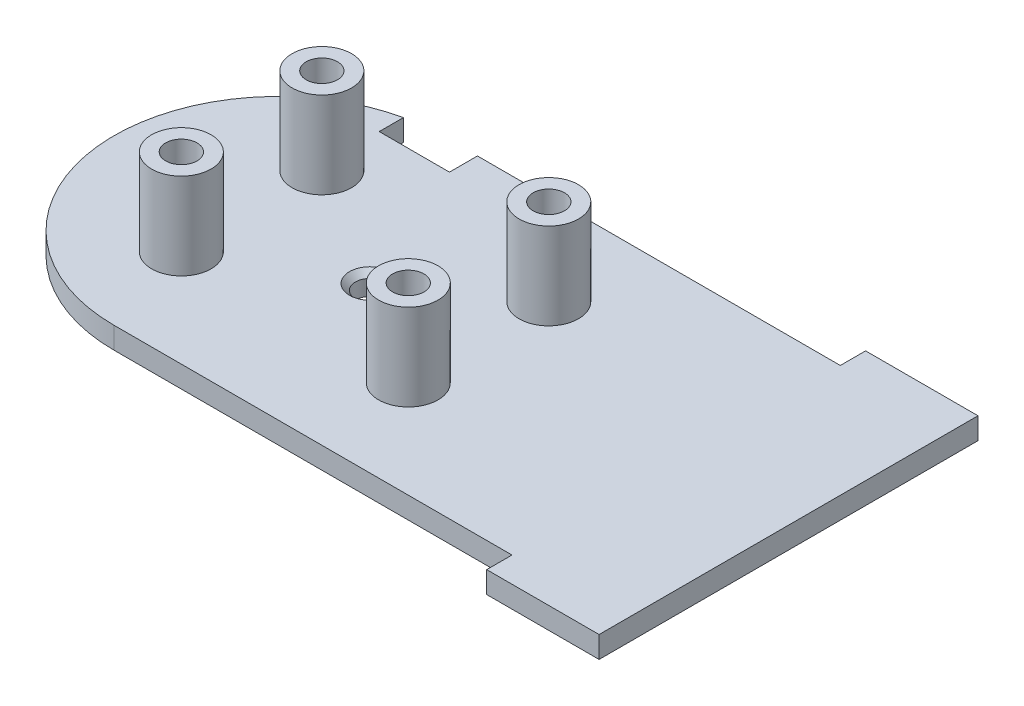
ISO-10303-21;
HEADER;
FILE_DESCRIPTION(('STEP AP214'),'2;1');
FILE_NAME('part.step','',(''),(''),'','','');
FILE_SCHEMA(('AUTOMOTIVE_DESIGN { 1 0 10303 214 1 1 1 1 }'));
ENDSEC;
DATA;
#1=APPLICATION_CONTEXT('core data for automotive mechanical design processes');
#2=APPLICATION_PROTOCOL_DEFINITION('international standard','automotive_design',2000,#1);
#3=PRODUCT_CONTEXT('',#1,'mechanical');
#4=PRODUCT('Part','Part','',(#3));
#5=PRODUCT_RELATED_PRODUCT_CATEGORY('part','',(#4));
#6=PRODUCT_DEFINITION_FORMATION('','',#4);
#7=PRODUCT_DEFINITION_CONTEXT('part definition',#1,'design');
#8=PRODUCT_DEFINITION('design','',#6,#7);
#9=PRODUCT_DEFINITION_SHAPE('','',#8);
#10=(LENGTH_UNIT() NAMED_UNIT(*) SI_UNIT(.MILLI.,.METRE.));
#11=(NAMED_UNIT(*) PLANE_ANGLE_UNIT() SI_UNIT($,.RADIAN.));
#12=(NAMED_UNIT(*) SI_UNIT($,.STERADIAN.) SOLID_ANGLE_UNIT());
#13=UNCERTAINTY_MEASURE_WITH_UNIT(LENGTH_MEASURE(1.E-05),#10,'distance_accuracy_value','');
#14=(GEOMETRIC_REPRESENTATION_CONTEXT(3) GLOBAL_UNCERTAINTY_ASSIGNED_CONTEXT((#13)) GLOBAL_UNIT_ASSIGNED_CONTEXT((#10,
#11,#12)) REPRESENTATION_CONTEXT('',''));
#15=CARTESIAN_POINT('',(0.,0.,0.));
#16=DIRECTION('',(0.,0.,1.));
#17=DIRECTION('',(1.,0.,0.));
#18=AXIS2_PLACEMENT_3D('',#15,#16,#17);
#19=CARTESIAN_POINT('',(-4.6,-0.1,-6.2));
#20=DIRECTION('',(0.,0.,1.));
#21=DIRECTION('',(1.,0.,0.));
#22=AXIS2_PLACEMENT_3D('',#19,#20,#21);
#23=PLANE('',#22);
#24=DIRECTION('',(0.,1.,0.));
#25=VECTOR('',#24,1.);
#26=CARTESIAN_POINT('',(4.6,-0.1,-6.2));
#27=LINE('',#26,#25);
#28=CARTESIAN_POINT('',(4.6,0.,-6.2));
#29=VERTEX_POINT('',#28);
#30=CARTESIAN_POINT('',(4.6,1.7,-6.2));
#31=VERTEX_POINT('',#30);
#32=EDGE_CURVE('E348',#29,#31,#27,.T.);
#33=ORIENTED_EDGE('',*,*,#32,.F.);
#34=DIRECTION('',(1.,0.,0.));
#35=VECTOR('',#34,1.);
#36=CARTESIAN_POINT('',(-4.6,0.,-6.2));
#37=LINE('',#36,#35);
#38=CARTESIAN_POINT('',(4.5,0.,-6.2));
#39=VERTEX_POINT('',#38);
#40=EDGE_CURVE('E350',#39,#29,#37,.T.);
#41=ORIENTED_EDGE('',*,*,#40,.F.);
#42=DIRECTION('',(0.,1.,0.));
#43=VECTOR('',#42,1.);
#44=CARTESIAN_POINT('',(4.5,-0.1,-6.2));
#45=LINE('',#44,#43);
#46=CARTESIAN_POINT('',(4.5,1.5,-6.2));
#47=VERTEX_POINT('',#46);
#48=EDGE_CURVE('E352',#47,#39,#45,.F.);
#49=ORIENTED_EDGE('',*,*,#48,.F.);
#50=DIRECTION('',(1.,0.,0.));
#51=VECTOR('',#50,1.);
#52=CARTESIAN_POINT('',(0.,1.5,-6.2));
#53=LINE('',#52,#51);
#54=CARTESIAN_POINT('',(-4.5,1.5,-6.2));
#55=VERTEX_POINT('',#54);
#56=EDGE_CURVE('E341',#47,#55,#53,.F.);
#57=ORIENTED_EDGE('',*,*,#56,.T.);
#58=DIRECTION('',(0.,1.,0.));
#59=VECTOR('',#58,1.);
#60=CARTESIAN_POINT('',(-4.5,-0.1,-6.2));
#61=LINE('',#60,#59);
#62=CARTESIAN_POINT('',(-4.5,0.,-6.2));
#63=VERTEX_POINT('',#62);
#64=EDGE_CURVE('E354',#63,#55,#61,.T.);
#65=ORIENTED_EDGE('',*,*,#64,.F.);
#66=DIRECTION('',(1.,0.,0.));
#67=VECTOR('',#66,1.);
#68=CARTESIAN_POINT('',(-4.6,0.,-6.2));
#69=LINE('',#68,#67);
#70=CARTESIAN_POINT('',(-4.6,0.,-6.2));
#71=VERTEX_POINT('',#70);
#72=EDGE_CURVE('E356',#71,#63,#69,.T.);
#73=ORIENTED_EDGE('',*,*,#72,.F.);
#74=DIRECTION('',(0.,1.,0.));
#75=VECTOR('',#74,1.);
#76=CARTESIAN_POINT('',(-4.6,-0.1,-6.2));
#77=LINE('',#76,#75);
#78=CARTESIAN_POINT('',(-4.6,1.7,-6.2));
#79=VERTEX_POINT('',#78);
#80=EDGE_CURVE('E358',#79,#71,#77,.F.);
#81=ORIENTED_EDGE('',*,*,#80,.F.);
#82=DIRECTION('',(1.,0.,0.));
#83=VECTOR('',#82,1.);
#84=CARTESIAN_POINT('',(-4.6,1.7,-6.2));
#85=LINE('',#84,#83);
#86=EDGE_CURVE('E316',#79,#31,#85,.T.);
#87=ORIENTED_EDGE('',*,*,#86,.T.);
#88=EDGE_LOOP('',(#33,#41,#49,#57,#65,#73,#81,#87));
#89=FACE_BOUND('',#88,.T.);
#90=ADVANCED_FACE('F16',(#89),#23,.F.);
#91=CARTESIAN_POINT('',(-4.6,-0.1,-7.9));
#92=DIRECTION('',(0.,0.,1.));
#93=DIRECTION('',(1.,0.,0.));
#94=AXIS2_PLACEMENT_3D('',#91,#92,#93);
#95=PLANE('',#94);
#96=DIRECTION('',(1.,0.,0.));
#97=VECTOR('',#96,1.);
#98=CARTESIAN_POINT('',(-4.6,0.,-7.9));
#99=LINE('',#98,#97);
#100=CARTESIAN_POINT('',(4.5,0.,-7.9));
#101=VERTEX_POINT('',#100);
#102=CARTESIAN_POINT('',(4.6,0.,-7.9));
#103=VERTEX_POINT('',#102);
#104=EDGE_CURVE('E344',#101,#103,#99,.T.);
#105=ORIENTED_EDGE('',*,*,#104,.T.);
#106=DIRECTION('',(0.,1.,0.));
#107=VECTOR('',#106,1.);
#108=CARTESIAN_POINT('',(4.6,-0.1,-7.9));
#109=LINE('',#108,#107);
#110=CARTESIAN_POINT('',(4.6,1.7,-7.9));
#111=VERTEX_POINT('',#110);
#112=EDGE_CURVE('E305',#103,#111,#109,.T.);
#113=ORIENTED_EDGE('',*,*,#112,.T.);
#114=DIRECTION('',(1.,0.,0.));
#115=VECTOR('',#114,1.);
#116=CARTESIAN_POINT('',(-4.6,1.7,-7.9));
#117=LINE('',#116,#115);
#118=CARTESIAN_POINT('',(3.25,1.7,-7.9));
#119=VERTEX_POINT('',#118);
#120=EDGE_CURVE('E313',#111,#119,#117,.F.);
#121=ORIENTED_EDGE('',*,*,#120,.T.);
#122=DIRECTION('',(0.,1.,0.));
#123=VECTOR('',#122,1.);
#124=CARTESIAN_POINT('',(3.25,-0.1,-7.9));
#125=LINE('',#124,#123);
#126=CARTESIAN_POINT('',(3.25,1.12487113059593,-7.89999999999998));
#127=VERTEX_POINT('',#126);
#128=EDGE_CURVE('E346',#119,#127,#125,.F.);
#129=ORIENTED_EDGE('',*,*,#128,.T.);
#130=DIRECTION('',(1.,0.,0.));
#131=VECTOR('',#130,1.);
#132=CARTESIAN_POINT('',(-10.29555495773,1.12487113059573,-7.89999999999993));
#133=LINE('',#132,#131);
#134=CARTESIAN_POINT('',(4.50000000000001,1.12487113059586,-7.89999999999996));
#135=VERTEX_POINT('',#134);
#136=EDGE_CURVE('E335',#135,#127,#133,.F.);
#137=ORIENTED_EDGE('',*,*,#136,.F.);
#138=DIRECTION('',(0.,1.,0.));
#139=VECTOR('',#138,1.);
#140=CARTESIAN_POINT('',(4.5,1.5,-7.9));
#141=LINE('',#140,#139);
#142=EDGE_CURVE('E307',#135,#101,#141,.F.);
#143=ORIENTED_EDGE('',*,*,#142,.T.);
#144=EDGE_LOOP('',(#105,#113,#121,#129,#137,#143));
#145=FACE_BOUND('',#144,.T.);
#146=ADVANCED_FACE('F587',(#145),#95,.T.);
#147=CARTESIAN_POINT('',(0.,1.5,0.));
#148=DIRECTION('',(0.,1.,0.));
#149=DIRECTION('',(0.,0.,1.));
#150=AXIS2_PLACEMENT_3D('',#147,#148,#149);
#151=PLANE('',#150);
#152=DIRECTION('',(0.,0.,-1.));
#153=VECTOR('',#152,1.);
#154=CARTESIAN_POINT('',(4.5,1.5,-6.5));
#155=LINE('',#154,#153);
#156=CARTESIAN_POINT('',(4.5,1.5,4.49999999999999));
#157=VERTEX_POINT('',#156);
#158=EDGE_CURVE('E300',#47,#157,#155,.F.);
#159=ORIENTED_EDGE('',*,*,#158,.T.);
#160=DIRECTION('',(1.,0.,0.));
#161=VECTOR('',#160,1.);
#162=CARTESIAN_POINT('',(-10.29555495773,1.5,4.5));
#163=LINE('',#162,#161);
#164=CARTESIAN_POINT('',(-4.5,1.5,4.5));
#165=VERTEX_POINT('',#164);
#166=EDGE_CURVE('E297',#165,#157,#163,.T.);
#167=ORIENTED_EDGE('',*,*,#166,.F.);
#168=DIRECTION('',(0.,0.,1.));
#169=VECTOR('',#168,1.);
#170=CARTESIAN_POINT('',(-4.5,1.5,-6.5));
#171=LINE('',#170,#169);
#172=EDGE_CURVE('E287',#165,#55,#171,.F.);
#173=ORIENTED_EDGE('',*,*,#172,.T.);
#174=ORIENTED_EDGE('',*,*,#56,.F.);
#175=EDGE_LOOP('',(#159,#167,#173,#174));
#176=FACE_BOUND('',#175,.T.);
#177=ADVANCED_FACE('F584',(#176),#151,.F.);
#178=CARTESIAN_POINT('',(-4.6,-0.1,-7.9));
#179=DIRECTION('',(0.,0.,1.));
#180=DIRECTION('',(1.,0.,0.));
#181=AXIS2_PLACEMENT_3D('',#178,#179,#180);
#182=PLANE('',#181);
#183=DIRECTION('',(0.,1.,0.));
#184=VECTOR('',#183,1.);
#185=CARTESIAN_POINT('',(-3.25,-0.1,-7.9));
#186=LINE('',#185,#184);
#187=CARTESIAN_POINT('',(-3.25,1.12487113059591,-7.89999999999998));
#188=VERTEX_POINT('',#187);
#189=CARTESIAN_POINT('',(-3.25,1.7,-7.9));
#190=VERTEX_POINT('',#189);
#191=EDGE_CURVE('E338',#188,#190,#186,.T.);
#192=ORIENTED_EDGE('',*,*,#191,.T.);
#193=DIRECTION('',(1.,0.,0.));
#194=VECTOR('',#193,1.);
#195=CARTESIAN_POINT('',(-4.6,1.7,-7.9));
#196=LINE('',#195,#194);
#197=CARTESIAN_POINT('',(-4.6,1.7,-7.9));
#198=VERTEX_POINT('',#197);
#199=EDGE_CURVE('E319',#190,#198,#196,.F.);
#200=ORIENTED_EDGE('',*,*,#199,.T.);
#201=DIRECTION('',(0.,1.,0.));
#202=VECTOR('',#201,1.);
#203=CARTESIAN_POINT('',(-4.6,-0.1,-7.9));
#204=LINE('',#203,#202);
#205=CARTESIAN_POINT('',(-4.6,0.,-7.9));
#206=VERTEX_POINT('',#205);
#207=EDGE_CURVE('E290',#206,#198,#204,.T.);
#208=ORIENTED_EDGE('',*,*,#207,.F.);
#209=DIRECTION('',(1.,0.,0.));
#210=VECTOR('',#209,1.);
#211=CARTESIAN_POINT('',(-4.6,0.,-7.9));
#212=LINE('',#211,#210);
#213=CARTESIAN_POINT('',(-4.5,0.,-7.9));
#214=VERTEX_POINT('',#213);
#215=EDGE_CURVE('E339',#206,#214,#212,.T.);
#216=ORIENTED_EDGE('',*,*,#215,.T.);
#217=DIRECTION('',(0.,1.,0.));
#218=VECTOR('',#217,1.);
#219=CARTESIAN_POINT('',(-4.5,1.5,-7.9));
#220=LINE('',#219,#218);
#221=CARTESIAN_POINT('',(-4.5,1.12487113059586,-7.89999999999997));
#222=VERTEX_POINT('',#221);
#223=EDGE_CURVE('E366',#214,#222,#220,.T.);
#224=ORIENTED_EDGE('',*,*,#223,.T.);
#225=DIRECTION('',(1.,0.,0.));
#226=VECTOR('',#225,1.);
#227=CARTESIAN_POINT('',(-10.29555495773,1.12487113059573,-7.89999999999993));
#228=LINE('',#227,#226);
#229=EDGE_CURVE('E326',#188,#222,#228,.F.);
#230=ORIENTED_EDGE('',*,*,#229,.F.);
#231=EDGE_LOOP('',(#192,#200,#208,#216,#224,#230));
#232=FACE_BOUND('',#231,.T.);
#233=ADVANCED_FACE('F580',(#232),#182,.T.);
#234=CARTESIAN_POINT('',(-10.29555495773,1.5,-6.5));
#235=DIRECTION('',(0.,-0.965925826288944,0.258819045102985));
#236=DIRECTION('',(0.,-0.258819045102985,-0.965925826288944));
#237=AXIS2_PLACEMENT_3D('',#234,#235,#236);
#238=PLANE('',#237);
#239=DIRECTION('',(0.,-0.25881904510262,-0.965925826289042));
#240=VECTOR('',#239,1.);
#241=CARTESIAN_POINT('',(3.25,1.124871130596,-7.9));
#242=LINE('',#241,#240);
#243=CARTESIAN_POINT('',(3.25000000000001,-9.30679144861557E-13,-12.0980762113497));
#244=VERTEX_POINT('',#243);
#245=EDGE_CURVE('E279',#127,#244,#242,.T.);
#246=ORIENTED_EDGE('',*,*,#245,.T.);
#247=DIRECTION('',(1.,0.,0.));
#248=VECTOR('',#247,1.);
#249=CARTESIAN_POINT('',(-10.29555495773,-1.86135828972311E-12,-12.0980762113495));
#250=LINE('',#249,#248);
#251=CARTESIAN_POINT('',(4.50000000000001,-9.30245463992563E-13,-12.0980762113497));
#252=VERTEX_POINT('',#251);
#253=EDGE_CURVE('E331',#244,#252,#250,.T.);
#254=ORIENTED_EDGE('',*,*,#253,.T.);
#255=DIRECTION('',(0.,0.25881904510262,0.965925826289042));
#256=VECTOR('',#255,1.);
#257=CARTESIAN_POINT('',(4.5,0.,-12.09807621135));
#258=LINE('',#257,#256);
#259=EDGE_CURVE('E310',#252,#135,#258,.T.);
#260=ORIENTED_EDGE('',*,*,#259,.T.);
#261=ORIENTED_EDGE('',*,*,#136,.T.);
#262=EDGE_LOOP('',(#246,#254,#260,#261));
#263=FACE_BOUND('',#262,.T.);
#264=ADVANCED_FACE('F576',(#263),#238,.T.);
#265=CARTESIAN_POINT('',(-10.29555495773,1.5,-6.5));
#266=DIRECTION('',(0.,-0.965925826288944,0.258819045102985));
#267=DIRECTION('',(0.,-0.258819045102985,-0.965925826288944));
#268=AXIS2_PLACEMENT_3D('',#265,#266,#267);
#269=PLANE('',#268);
#270=DIRECTION('',(0.,-0.25881904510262,-0.965925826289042));
#271=VECTOR('',#270,1.);
#272=CARTESIAN_POINT('',(-4.5,1.124871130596,-7.9));
#273=LINE('',#272,#271);
#274=CARTESIAN_POINT('',(-4.5,-1.86135828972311E-12,-12.0980762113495));
#275=VERTEX_POINT('',#274);
#276=EDGE_CURVE('E283',#222,#275,#273,.T.);
#277=ORIENTED_EDGE('',*,*,#276,.T.);
#278=DIRECTION('',(1.,0.,0.));
#279=VECTOR('',#278,1.);
#280=CARTESIAN_POINT('',(-10.29555495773,-1.86135828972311E-12,-12.0980762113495));
#281=LINE('',#280,#279);
#282=CARTESIAN_POINT('',(-3.25,-6.2052504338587E-13,-12.0980762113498));
#283=VERTEX_POINT('',#282);
#284=EDGE_CURVE('E321',#275,#283,#281,.T.);
#285=ORIENTED_EDGE('',*,*,#284,.T.);
#286=DIRECTION('',(0.,-0.25881904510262,-0.965925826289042));
#287=VECTOR('',#286,1.);
#288=CARTESIAN_POINT('',(-3.25,1.124871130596,-7.9));
#289=LINE('',#288,#287);
#290=EDGE_CURVE('E282',#188,#283,#289,.T.);
#291=ORIENTED_EDGE('',*,*,#290,.F.);
#292=ORIENTED_EDGE('',*,*,#229,.T.);
#293=EDGE_LOOP('',(#277,#285,#291,#292));
#294=FACE_BOUND('',#293,.T.);
#295=ADVANCED_FACE('F573',(#294),#269,.T.);
#296=CARTESIAN_POINT('',(-2.775,5.,-6.816883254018));
#297=DIRECTION('',(0.,1.,0.));
#298=DIRECTION('',(0.,0.,1.));
#299=AXIS2_PLACEMENT_3D('',#296,#297,#298);
#300=PLANE('',#299);
#301=CARTESIAN_POINT('',(-2.775,5.,-6.816883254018));
#302=DIRECTION('',(0.,1.,0.));
#303=DIRECTION('',(0.,0.,1.));
#304=AXIS2_PLACEMENT_3D('',#301,#302,#303);
#305=CIRCLE('',#304,1.45);
#306=CARTESIAN_POINT('',(-2.775,5.,-5.366883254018));
#307=VERTEX_POINT('',#306);
#308=EDGE_CURVE('E19',#307,#307,#305,.T.);
#309=ORIENTED_EDGE('',*,*,#308,.T.);
#310=EDGE_LOOP('',(#309));
#311=FACE_BOUND('',#310,.T.);
#312=ADVANCED_FACE('F431',(#311),#300,.T.);
#313=CARTESIAN_POINT('',(-2.775,5.,6.183116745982));
#314=DIRECTION('',(0.,1.,0.));
#315=DIRECTION('',(0.,0.,1.));
#316=AXIS2_PLACEMENT_3D('',#313,#314,#315);
#317=PLANE('',#316);
#318=CARTESIAN_POINT('',(-2.775,5.,6.183116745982));
#319=DIRECTION('',(0.,1.,0.));
#320=DIRECTION('',(0.,0.,1.));
#321=AXIS2_PLACEMENT_3D('',#318,#319,#320);
#322=CIRCLE('',#321,1.45);
#323=CARTESIAN_POINT('',(-2.775,5.,7.633116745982));
#324=VERTEX_POINT('',#323);
#325=EDGE_CURVE('E424',#324,#324,#322,.T.);
#326=ORIENTED_EDGE('',*,*,#325,.T.);
#327=EDGE_LOOP('',(#326));
#328=FACE_BOUND('',#327,.T.);
#329=ADVANCED_FACE('F559',(#328),#317,.T.);
#330=CARTESIAN_POINT('',(18.225,5.,-6.816883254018));
#331=DIRECTION('',(0.,1.,0.));
#332=DIRECTION('',(0.,0.,1.));
#333=AXIS2_PLACEMENT_3D('',#330,#331,#332);
#334=PLANE('',#333);
#335=CARTESIAN_POINT('',(18.225,5.,-6.816883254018));
#336=DIRECTION('',(0.,1.,0.));
#337=DIRECTION('',(0.,0.,1.));
#338=AXIS2_PLACEMENT_3D('',#335,#336,#337);
#339=CIRCLE('',#338,1.45);
#340=CARTESIAN_POINT('',(18.225,5.,-5.366883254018));
#341=VERTEX_POINT('',#340);
#342=EDGE_CURVE('E422',#341,#341,#339,.T.);
#343=ORIENTED_EDGE('',*,*,#342,.T.);
#344=EDGE_LOOP('',(#343));
#345=FACE_BOUND('',#344,.T.);
#346=ADVANCED_FACE('F556',(#345),#334,.T.);
#347=CARTESIAN_POINT('',(18.225,5.,6.183116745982));
#348=DIRECTION('',(0.,1.,0.));
#349=DIRECTION('',(0.,0.,1.));
#350=AXIS2_PLACEMENT_3D('',#347,#348,#349);
#351=PLANE('',#350);
#352=CARTESIAN_POINT('',(18.225,5.,6.183116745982));
#353=DIRECTION('',(0.,1.,0.));
#354=DIRECTION('',(0.,0.,1.));
#355=AXIS2_PLACEMENT_3D('',#352,#353,#354);
#356=CIRCLE('',#355,1.45);
#357=CARTESIAN_POINT('',(18.225,5.,7.633116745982));
#358=VERTEX_POINT('',#357);
#359=EDGE_CURVE('E268',#358,#358,#356,.T.);
#360=ORIENTED_EDGE('',*,*,#359,.T.);
#361=EDGE_LOOP('',(#360));
#362=FACE_BOUND('',#361,.T.);
#363=ADVANCED_FACE('F558',(#362),#351,.T.);
#364=CARTESIAN_POINT('',(4.5,1.5,-6.5));
#365=DIRECTION('',(1.,0.,0.));
#366=DIRECTION('',(0.,0.,-1.));
#367=AXIS2_PLACEMENT_3D('',#364,#365,#366);
#368=PLANE('',#367);
#369=ORIENTED_EDGE('',*,*,#259,.F.);
#370=DIRECTION('',(0.,0.,1.));
#371=VECTOR('',#370,1.);
#372=CARTESIAN_POINT('',(4.5,0.,0.));
#373=LINE('',#372,#371);
#374=EDGE_CURVE('E266',#252,#101,#373,.T.);
#375=ORIENTED_EDGE('',*,*,#374,.T.);
#376=ORIENTED_EDGE('',*,*,#142,.F.);
#377=EDGE_LOOP('',(#369,#375,#376));
#378=FACE_BOUND('',#377,.T.);
#379=ADVANCED_FACE('F565',(#378),#368,.F.);
#380=CARTESIAN_POINT('',(4.6,-0.1,-7.9));
#381=DIRECTION('',(1.,0.,0.));
#382=DIRECTION('',(0.,0.,-1.));
#383=AXIS2_PLACEMENT_3D('',#380,#381,#382);
#384=PLANE('',#383);
#385=ORIENTED_EDGE('',*,*,#112,.F.);
#386=DIRECTION('',(0.,0.,1.));
#387=VECTOR('',#386,1.);
#388=CARTESIAN_POINT('',(4.6,0.,0.));
#389=LINE('',#388,#387);
#390=EDGE_CURVE('E263',#103,#29,#389,.T.);
#391=ORIENTED_EDGE('',*,*,#390,.T.);
#392=ORIENTED_EDGE('',*,*,#32,.T.);
#393=DIRECTION('',(0.,0.,-1.));
#394=VECTOR('',#393,1.);
#395=CARTESIAN_POINT('',(4.6,1.7,-7.9));
#396=LINE('',#395,#394);
#397=EDGE_CURVE('E302',#111,#31,#396,.F.);
#398=ORIENTED_EDGE('',*,*,#397,.F.);
#399=EDGE_LOOP('',(#385,#391,#392,#398));
#400=FACE_BOUND('',#399,.T.);
#401=ADVANCED_FACE('F602',(#400),#384,.F.);
#402=CARTESIAN_POINT('',(4.5,1.5,-6.5));
#403=DIRECTION('',(1.,0.,0.));
#404=DIRECTION('',(0.,0.,-1.));
#405=AXIS2_PLACEMENT_3D('',#402,#403,#404);
#406=PLANE('',#405);
#407=ORIENTED_EDGE('',*,*,#158,.F.);
#408=ORIENTED_EDGE('',*,*,#48,.T.);
#409=DIRECTION('',(0.,0.,1.));
#410=VECTOR('',#409,1.);
#411=CARTESIAN_POINT('',(4.5,0.,0.));
#412=LINE('',#411,#410);
#413=CARTESIAN_POINT('',(4.5,-2.91054073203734E-13,10.0980762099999));
#414=VERTEX_POINT('',#413);
#415=EDGE_CURVE('E261',#39,#414,#412,.T.);
#416=ORIENTED_EDGE('',*,*,#415,.T.);
#417=DIRECTION('',(0.,0.2588190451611,-0.965925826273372));
#418=VECTOR('',#417,1.);
#419=CARTESIAN_POINT('',(4.50000000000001,1.5,4.5));
#420=LINE('',#419,#418);
#421=EDGE_CURVE('E294',#157,#414,#420,.F.);
#422=ORIENTED_EDGE('',*,*,#421,.F.);
#423=EDGE_LOOP('',(#407,#408,#416,#422));
#424=FACE_BOUND('',#423,.T.);
#425=ADVANCED_FACE('F626',(#424),#406,.F.);
#426=CARTESIAN_POINT('',(-10.29555495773,1.5,4.5));
#427=DIRECTION('',(0.,-0.965925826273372,-0.2588190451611));
#428=DIRECTION('',(0.,0.2588190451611,-0.965925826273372));
#429=AXIS2_PLACEMENT_3D('',#426,#427,#428);
#430=PLANE('',#429);
#431=ORIENTED_EDGE('',*,*,#421,.T.);
#432=DIRECTION('',(1.,0.,0.));
#433=VECTOR('',#432,1.);
#434=CARTESIAN_POINT('',(0.,0.,10.09807621));
#435=LINE('',#434,#433);
#436=CARTESIAN_POINT('',(-4.5,-5.83734449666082E-13,10.0980762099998));
#437=VERTEX_POINT('',#436);
#438=EDGE_CURVE('E259',#414,#437,#435,.F.);
#439=ORIENTED_EDGE('',*,*,#438,.T.);
#440=DIRECTION('',(0.,0.258819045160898,-0.965925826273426));
#441=VECTOR('',#440,1.);
#442=CARTESIAN_POINT('',(-4.5,0.,10.09807621));
#443=LINE('',#442,#441);
#444=EDGE_CURVE('E291',#437,#165,#443,.T.);
#445=ORIENTED_EDGE('',*,*,#444,.T.);
#446=ORIENTED_EDGE('',*,*,#166,.T.);
#447=EDGE_LOOP('',(#431,#439,#445,#446));
#448=FACE_BOUND('',#447,.T.);
#449=ADVANCED_FACE('F631',(#448),#430,.T.);
#450=CARTESIAN_POINT('',(-4.5,1.5,-6.5));
#451=DIRECTION('',(-1.,0.,0.));
#452=DIRECTION('',(0.,0.,1.));
#453=AXIS2_PLACEMENT_3D('',#450,#451,#452);
#454=PLANE('',#453);
#455=ORIENTED_EDGE('',*,*,#172,.F.);
#456=ORIENTED_EDGE('',*,*,#444,.F.);
#457=DIRECTION('',(0.,0.,1.));
#458=VECTOR('',#457,1.);
#459=CARTESIAN_POINT('',(-4.5,0.,0.));
#460=LINE('',#459,#458);
#461=EDGE_CURVE('E256',#437,#63,#460,.F.);
#462=ORIENTED_EDGE('',*,*,#461,.T.);
#463=ORIENTED_EDGE('',*,*,#64,.T.);
#464=EDGE_LOOP('',(#455,#456,#462,#463));
#465=FACE_BOUND('',#464,.T.);
#466=ADVANCED_FACE('F635',(#465),#454,.F.);
#467=CARTESIAN_POINT('',(-4.6,-0.1,-7.9));
#468=DIRECTION('',(1.,0.,0.));
#469=DIRECTION('',(0.,0.,-1.));
#470=AXIS2_PLACEMENT_3D('',#467,#468,#469);
#471=PLANE('',#470);
#472=ORIENTED_EDGE('',*,*,#207,.T.);
#473=DIRECTION('',(0.,0.,-1.));
#474=VECTOR('',#473,1.);
#475=CARTESIAN_POINT('',(-4.6,1.7,-7.9));
#476=LINE('',#475,#474);
#477=EDGE_CURVE('E363',#198,#79,#476,.F.);
#478=ORIENTED_EDGE('',*,*,#477,.T.);
#479=ORIENTED_EDGE('',*,*,#80,.T.);
#480=DIRECTION('',(0.,0.,1.));
#481=VECTOR('',#480,1.);
#482=CARTESIAN_POINT('',(-4.6,0.,0.));
#483=LINE('',#482,#481);
#484=EDGE_CURVE('E253',#71,#206,#483,.F.);
#485=ORIENTED_EDGE('',*,*,#484,.T.);
#486=EDGE_LOOP('',(#472,#478,#479,#485));
#487=FACE_BOUND('',#486,.T.);
#488=ADVANCED_FACE('F447',(#487),#471,.T.);
#489=CARTESIAN_POINT('',(-4.5,1.5,-6.5));
#490=DIRECTION('',(-1.,0.,0.));
#491=DIRECTION('',(0.,0.,1.));
#492=AXIS2_PLACEMENT_3D('',#489,#490,#491);
#493=PLANE('',#492);
#494=ORIENTED_EDGE('',*,*,#223,.F.);
#495=DIRECTION('',(0.,0.,1.));
#496=VECTOR('',#495,1.);
#497=CARTESIAN_POINT('',(-4.5,0.,0.));
#498=LINE('',#497,#496);
#499=EDGE_CURVE('E243',#214,#275,#498,.F.);
#500=ORIENTED_EDGE('',*,*,#499,.T.);
#501=ORIENTED_EDGE('',*,*,#276,.F.);
#502=EDGE_LOOP('',(#494,#500,#501));
#503=FACE_BOUND('',#502,.T.);
#504=ADVANCED_FACE('F436',(#503),#493,.F.);
#505=CARTESIAN_POINT('',(-2.775,5.,-6.816883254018));
#506=DIRECTION('',(0.,1.,0.));
#507=DIRECTION('',(0.,0.,1.));
#508=AXIS2_PLACEMENT_3D('',#505,#506,#507);
#509=CYLINDRICAL_SURFACE('',#508,1.45);
#510=CARTESIAN_POINT('',(-2.775,10.,-6.816883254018));
#511=DIRECTION('',(0.,1.,0.));
#512=DIRECTION('',(0.,0.,1.));
#513=AXIS2_PLACEMENT_3D('',#510,#511,#512);
#514=CIRCLE('',#513,1.45);
#515=CARTESIAN_POINT('',(-2.775,10.,-5.366883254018));
#516=VERTEX_POINT('',#515);
#517=EDGE_CURVE('E246',#516,#516,#514,.F.);
#518=ORIENTED_EDGE('',*,*,#517,.F.);
#519=EDGE_LOOP('',(#518));
#520=FACE_BOUND('',#519,.T.);
#521=ORIENTED_EDGE('',*,*,#308,.F.);
#522=EDGE_LOOP('',(#521));
#523=FACE_BOUND('',#522,.T.);
#524=ADVANCED_FACE('F433',(#520,#523),#509,.F.);
#525=CARTESIAN_POINT('',(-2.775,5.,6.183116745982));
#526=DIRECTION('',(0.,1.,0.));
#527=DIRECTION('',(0.,0.,1.));
#528=AXIS2_PLACEMENT_3D('',#525,#526,#527);
#529=CYLINDRICAL_SURFACE('',#528,1.45);
#530=CARTESIAN_POINT('',(-2.775,10.,6.183116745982));
#531=DIRECTION('',(0.,1.,0.));
#532=DIRECTION('',(0.,0.,1.));
#533=AXIS2_PLACEMENT_3D('',#530,#531,#532);
#534=CIRCLE('',#533,1.45);
#535=CARTESIAN_POINT('',(-2.775,10.,7.633116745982));
#536=VERTEX_POINT('',#535);
#537=EDGE_CURVE('E415',#536,#536,#534,.F.);
#538=ORIENTED_EDGE('',*,*,#537,.F.);
#539=EDGE_LOOP('',(#538));
#540=FACE_BOUND('',#539,.T.);
#541=ORIENTED_EDGE('',*,*,#325,.F.);
#542=EDGE_LOOP('',(#541));
#543=FACE_BOUND('',#542,.T.);
#544=ADVANCED_FACE('F435',(#540,#543),#529,.F.);
#545=CARTESIAN_POINT('',(18.225,5.,-6.816883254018));
#546=DIRECTION('',(0.,1.,0.));
#547=DIRECTION('',(0.,0.,1.));
#548=AXIS2_PLACEMENT_3D('',#545,#546,#547);
#549=CYLINDRICAL_SURFACE('',#548,1.45);
#550=CARTESIAN_POINT('',(18.225,10.,-6.816883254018));
#551=DIRECTION('',(0.,1.,0.));
#552=DIRECTION('',(0.,0.,1.));
#553=AXIS2_PLACEMENT_3D('',#550,#551,#552);
#554=CIRCLE('',#553,1.45);
#555=CARTESIAN_POINT('',(18.225,10.,-5.366883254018));
#556=VERTEX_POINT('',#555);
#557=EDGE_CURVE('E412',#556,#556,#554,.F.);
#558=ORIENTED_EDGE('',*,*,#557,.F.);
#559=EDGE_LOOP('',(#558));
#560=FACE_BOUND('',#559,.T.);
#561=ORIENTED_EDGE('',*,*,#342,.F.);
#562=EDGE_LOOP('',(#561));
#563=FACE_BOUND('',#562,.T.);
#564=ADVANCED_FACE('F444',(#560,#563),#549,.F.);
#565=CARTESIAN_POINT('',(18.225,5.,6.183116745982));
#566=DIRECTION('',(0.,1.,0.));
#567=DIRECTION('',(0.,0.,1.));
#568=AXIS2_PLACEMENT_3D('',#565,#566,#567);
#569=CYLINDRICAL_SURFACE('',#568,1.45);
#570=CARTESIAN_POINT('',(18.225,10.,6.183116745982));
#571=DIRECTION('',(0.,1.,0.));
#572=DIRECTION('',(0.,0.,1.));
#573=AXIS2_PLACEMENT_3D('',#570,#571,#572);
#574=CIRCLE('',#573,1.45);
#575=CARTESIAN_POINT('',(18.225,10.,7.633116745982));
#576=VERTEX_POINT('',#575);
#577=EDGE_CURVE('E276',#576,#576,#574,.F.);
#578=ORIENTED_EDGE('',*,*,#577,.F.);
#579=EDGE_LOOP('',(#578));
#580=FACE_BOUND('',#579,.T.);
#581=ORIENTED_EDGE('',*,*,#359,.F.);
#582=EDGE_LOOP('',(#581));
#583=FACE_BOUND('',#582,.T.);
#584=ADVANCED_FACE('F543',(#580,#583),#569,.F.);
#585=CARTESIAN_POINT('',(0.,0.,0.));
#586=DIRECTION('',(0.,1.,0.));
#587=DIRECTION('',(0.,0.,1.));
#588=AXIS2_PLACEMENT_3D('',#585,#586,#587);
#589=PLANE('',#588);
#590=CARTESIAN_POINT('',(8.5,0.,0.));
#591=DIRECTION('',(0.,1.,0.));
#592=DIRECTION('',(0.,0.,1.));
#593=AXIS2_PLACEMENT_3D('',#590,#591,#592);
#594=CIRCLE('',#593,1.35);
#595=CARTESIAN_POINT('',(8.5,0.,1.35));
#596=VERTEX_POINT('',#595);
#597=EDGE_CURVE('E409',#596,#596,#594,.T.);
#598=ORIENTED_EDGE('',*,*,#597,.T.);
#599=EDGE_LOOP('',(#598));
#600=FACE_BOUND('',#599,.T.);
#601=DIRECTION('',(0.,0.,-1.));
#602=VECTOR('',#601,1.);
#603=CARTESIAN_POINT('',(-3.25,0.,-19.35));
#604=LINE('',#603,#602);
#605=CARTESIAN_POINT('',(-3.25000000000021,0.,-14.8382478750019));
#606=VERTEX_POINT('',#605);
#607=EDGE_CURVE('E179',#283,#606,#604,.T.);
#608=ORIENTED_EDGE('',*,*,#607,.F.);
#609=ORIENTED_EDGE('',*,*,#284,.F.);
#610=ORIENTED_EDGE('',*,*,#499,.F.);
#611=ORIENTED_EDGE('',*,*,#215,.F.);
#612=ORIENTED_EDGE('',*,*,#484,.F.);
#613=ORIENTED_EDGE('',*,*,#72,.T.);
#614=ORIENTED_EDGE('',*,*,#461,.F.);
#615=ORIENTED_EDGE('',*,*,#438,.F.);
#616=ORIENTED_EDGE('',*,*,#415,.F.);
#617=ORIENTED_EDGE('',*,*,#40,.T.);
#618=ORIENTED_EDGE('',*,*,#390,.F.);
#619=ORIENTED_EDGE('',*,*,#104,.F.);
#620=ORIENTED_EDGE('',*,*,#374,.F.);
#621=ORIENTED_EDGE('',*,*,#253,.F.);
#622=DIRECTION('',(0.,0.,-1.));
#623=VECTOR('',#622,1.);
#624=CARTESIAN_POINT('',(3.25,0.,-19.35));
#625=LINE('',#624,#623);
#626=CARTESIAN_POINT('',(3.25,0.,-15.19));
#627=VERTEX_POINT('',#626);
#628=EDGE_CURVE('E616',#244,#627,#625,.T.);
#629=ORIENTED_EDGE('',*,*,#628,.T.);
#630=DIRECTION('',(-1.,0.,0.));
#631=VECTOR('',#630,1.);
#632=CARTESIAN_POINT('',(0.,0.,-15.19));
#633=LINE('',#632,#631);
#634=CARTESIAN_POINT('',(36.825,0.,-15.19));
#635=VERTEX_POINT('',#634);
#636=EDGE_CURVE('E681',#635,#627,#633,.T.);
#637=ORIENTED_EDGE('',*,*,#636,.F.);
#638=DIRECTION('',(0.,0.,1.));
#639=VECTOR('',#638,1.);
#640=CARTESIAN_POINT('',(36.825,0.,-15.19));
#641=LINE('',#640,#639);
#642=CARTESIAN_POINT('',(36.825,0.,-17.5294293));
#643=VERTEX_POINT('',#642);
#644=EDGE_CURVE('E686',#643,#635,#641,.T.);
#645=ORIENTED_EDGE('',*,*,#644,.F.);
#646=DIRECTION('',(-1.,0.,0.));
#647=VECTOR('',#646,1.);
#648=CARTESIAN_POINT('',(38.325,0.,-17.5294293));
#649=LINE('',#648,#647);
#650=CARTESIAN_POINT('',(47.225,0.,-17.5294293));
#651=VERTEX_POINT('',#650);
#652=EDGE_CURVE('E692',#651,#643,#649,.T.);
#653=ORIENTED_EDGE('',*,*,#652,.F.);
#654=DIRECTION('',(0.,0.,-1.));
#655=VECTOR('',#654,1.);
#656=CARTESIAN_POINT('',(47.225,0.,-17.5294293));
#657=LINE('',#656,#655);
#658=CARTESIAN_POINT('',(47.225,0.,17.5294293));
#659=VERTEX_POINT('',#658);
#660=EDGE_CURVE('E698',#659,#651,#657,.T.);
#661=ORIENTED_EDGE('',*,*,#660,.F.);
#662=DIRECTION('',(1.,0.,0.));
#663=VECTOR('',#662,1.);
#664=CARTESIAN_POINT('',(47.225,0.,17.5294293));
#665=LINE('',#664,#663);
#666=CARTESIAN_POINT('',(36.825,0.,17.5294293));
#667=VERTEX_POINT('',#666);
#668=EDGE_CURVE('E210',#667,#659,#665,.T.);
#669=ORIENTED_EDGE('',*,*,#668,.F.);
#670=DIRECTION('',(0.,0.,-1.));
#671=VECTOR('',#670,1.);
#672=CARTESIAN_POINT('',(36.825,0.,15.19));
#673=LINE('',#672,#671);
#674=CARTESIAN_POINT('',(36.825,0.,15.19));
#675=VERTEX_POINT('',#674);
#676=EDGE_CURVE('E198',#667,#675,#673,.T.);
#677=ORIENTED_EDGE('',*,*,#676,.T.);
#678=DIRECTION('',(-1.,0.,0.));
#679=VECTOR('',#678,1.);
#680=CARTESIAN_POINT('',(0.,0.,15.19));
#681=LINE('',#680,#679);
#682=CARTESIAN_POINT('',(0.,0.,15.19));
#683=VERTEX_POINT('',#682);
#684=EDGE_CURVE('E195',#675,#683,#681,.T.);
#685=ORIENTED_EDGE('',*,*,#684,.T.);
#686=CARTESIAN_POINT('',(0.,0.,0.));
#687=DIRECTION('',(0.,-1.,0.));
#688=DIRECTION('',(0.,0.,-1.));
#689=AXIS2_PLACEMENT_3D('',#686,#687,#688);
#690=CIRCLE('',#689,15.19);
#691=EDGE_CURVE('E184',#606,#683,#690,.F.);
#692=ORIENTED_EDGE('',*,*,#691,.F.);
#693=EDGE_LOOP('',(#608,#609,#610,#611,#612,#613,#614,#615,#616,#617,#618,#619,#620,#621,#629,
#637,#645,#653,#661,#669,#677,#685,#692));
#694=FACE_BOUND('',#693,.T.);
#695=ADVANCED_FACE('F196',(#600,#694),#589,.F.);
#696=CARTESIAN_POINT('',(-3.25,1.7,-12.9));
#697=DIRECTION('',(0.,1.,0.));
#698=DIRECTION('',(0.,0.,1.));
#699=AXIS2_PLACEMENT_3D('',#696,#697,#698);
#700=PLANE('',#699);
#701=DIRECTION('',(0.,0.,1.));
#702=VECTOR('',#701,1.);
#703=CARTESIAN_POINT('',(-3.25,1.7,-12.9));
#704=LINE('',#703,#702);
#705=CARTESIAN_POINT('',(-3.25,1.7,-12.6));
#706=VERTEX_POINT('',#705);
#707=EDGE_CURVE('E242',#706,#190,#704,.T.);
#708=ORIENTED_EDGE('',*,*,#707,.F.);
#709=DIRECTION('',(1.,0.,0.));
#710=VECTOR('',#709,1.);
#711=CARTESIAN_POINT('',(-3.25,1.7,-12.6));
#712=LINE('',#711,#710);
#713=CARTESIAN_POINT('',(3.25,1.7,-12.6));
#714=VERTEX_POINT('',#713);
#715=EDGE_CURVE('E224',#706,#714,#712,.T.);
#716=ORIENTED_EDGE('',*,*,#715,.T.);
#717=DIRECTION('',(0.,0.,1.));
#718=VECTOR('',#717,1.);
#719=CARTESIAN_POINT('',(3.25,1.7,-12.9));
#720=LINE('',#719,#718);
#721=EDGE_CURVE('E240',#119,#714,#720,.F.);
#722=ORIENTED_EDGE('',*,*,#721,.F.);
#723=ORIENTED_EDGE('',*,*,#120,.F.);
#724=ORIENTED_EDGE('',*,*,#397,.T.);
#725=ORIENTED_EDGE('',*,*,#86,.F.);
#726=ORIENTED_EDGE('',*,*,#477,.F.);
#727=ORIENTED_EDGE('',*,*,#199,.F.);
#728=EDGE_LOOP('',(#708,#716,#722,#723,#724,#725,#726,#727));
#729=FACE_BOUND('',#728,.T.);
#730=ADVANCED_FACE('F536',(#729),#700,.F.);
#731=CARTESIAN_POINT('',(-2.775,10.,-6.816883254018));
#732=DIRECTION('',(0.,1.,0.));
#733=DIRECTION('',(0.,0.,1.));
#734=AXIS2_PLACEMENT_3D('',#731,#732,#733);
#735=PLANE('',#734);
#736=CARTESIAN_POINT('',(-2.775,10.,-6.816883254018));
#737=DIRECTION('',(0.,-1.,0.));
#738=DIRECTION('',(0.,0.,-1.));
#739=AXIS2_PLACEMENT_3D('',#736,#737,#738);
#740=CIRCLE('',#739,2.75);
#741=CARTESIAN_POINT('',(-2.775,10.,-9.566883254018));
#742=VERTEX_POINT('',#741);
#743=EDGE_CURVE('E404',#742,#742,#740,.T.);
#744=ORIENTED_EDGE('',*,*,#743,.F.);
#745=EDGE_LOOP('',(#744));
#746=FACE_BOUND('',#745,.T.);
#747=ORIENTED_EDGE('',*,*,#517,.T.);
#748=EDGE_LOOP('',(#747));
#749=FACE_BOUND('',#748,.T.);
#750=ADVANCED_FACE('F532',(#746,#749),#735,.T.);
#751=CARTESIAN_POINT('',(-2.775,10.,6.183116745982));
#752=DIRECTION('',(0.,1.,0.));
#753=DIRECTION('',(0.,0.,1.));
#754=AXIS2_PLACEMENT_3D('',#751,#752,#753);
#755=PLANE('',#754);
#756=CARTESIAN_POINT('',(-2.775,10.,6.183116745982));
#757=DIRECTION('',(0.,-1.,0.));
#758=DIRECTION('',(0.,0.,-1.));
#759=AXIS2_PLACEMENT_3D('',#756,#757,#758);
#760=CIRCLE('',#759,2.75);
#761=CARTESIAN_POINT('',(-2.775,10.,3.433116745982));
#762=VERTEX_POINT('',#761);
#763=EDGE_CURVE('E401',#762,#762,#760,.T.);
#764=ORIENTED_EDGE('',*,*,#763,.F.);
#765=EDGE_LOOP('',(#764));
#766=FACE_BOUND('',#765,.T.);
#767=ORIENTED_EDGE('',*,*,#537,.T.);
#768=EDGE_LOOP('',(#767));
#769=FACE_BOUND('',#768,.T.);
#770=ADVANCED_FACE('F528',(#766,#769),#755,.T.);
#771=CARTESIAN_POINT('',(18.225,10.,-6.816883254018));
#772=DIRECTION('',(0.,1.,0.));
#773=DIRECTION('',(0.,0.,1.));
#774=AXIS2_PLACEMENT_3D('',#771,#772,#773);
#775=PLANE('',#774);
#776=CARTESIAN_POINT('',(18.225,10.,-6.816883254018));
#777=DIRECTION('',(0.,-1.,0.));
#778=DIRECTION('',(0.,0.,-1.));
#779=AXIS2_PLACEMENT_3D('',#776,#777,#778);
#780=CIRCLE('',#779,2.75);
#781=CARTESIAN_POINT('',(18.225,10.,-9.566883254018));
#782=VERTEX_POINT('',#781);
#783=EDGE_CURVE('E239',#782,#782,#780,.T.);
#784=ORIENTED_EDGE('',*,*,#783,.F.);
#785=EDGE_LOOP('',(#784));
#786=FACE_BOUND('',#785,.T.);
#787=ORIENTED_EDGE('',*,*,#557,.T.);
#788=EDGE_LOOP('',(#787));
#789=FACE_BOUND('',#788,.T.);
#790=ADVANCED_FACE('F524',(#786,#789),#775,.T.);
#791=CARTESIAN_POINT('',(8.5,0.,0.));
#792=DIRECTION('',(0.,1.,0.));
#793=DIRECTION('',(0.,0.,1.));
#794=AXIS2_PLACEMENT_3D('',#791,#792,#793);
#795=CYLINDRICAL_SURFACE('',#794,1.35);
#796=CARTESIAN_POINT('',(8.5,1.44999999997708,0.));
#797=DIRECTION('',(0.,1.,0.));
#798=DIRECTION('',(0.,0.,1.));
#799=AXIS2_PLACEMENT_3D('',#796,#797,#798);
#800=CIRCLE('',#799,1.34999999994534);
#801=CARTESIAN_POINT('',(8.5,1.44999999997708,1.34999999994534));
#802=VERTEX_POINT('',#801);
#803=EDGE_CURVE('E235',#802,#802,#800,.T.);
#804=ORIENTED_EDGE('',*,*,#803,.T.);
#805=EDGE_LOOP('',(#804));
#806=FACE_BOUND('',#805,.T.);
#807=ORIENTED_EDGE('',*,*,#597,.F.);
#808=EDGE_LOOP('',(#807));
#809=FACE_BOUND('',#808,.T.);
#810=ADVANCED_FACE('F520',(#806,#809),#795,.F.);
#811=CARTESIAN_POINT('',(18.225,10.,6.183116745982));
#812=DIRECTION('',(0.,1.,0.));
#813=DIRECTION('',(0.,0.,1.));
#814=AXIS2_PLACEMENT_3D('',#811,#812,#813);
#815=PLANE('',#814);
#816=CARTESIAN_POINT('',(18.225,10.,6.183116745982));
#817=DIRECTION('',(0.,-1.,0.));
#818=DIRECTION('',(0.,0.,-1.));
#819=AXIS2_PLACEMENT_3D('',#816,#817,#818);
#820=CIRCLE('',#819,2.75);
#821=CARTESIAN_POINT('',(18.225,10.,3.433116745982));
#822=VERTEX_POINT('',#821);
#823=EDGE_CURVE('E238',#822,#822,#820,.T.);
#824=ORIENTED_EDGE('',*,*,#823,.F.);
#825=EDGE_LOOP('',(#824));
#826=FACE_BOUND('',#825,.T.);
#827=ORIENTED_EDGE('',*,*,#577,.T.);
#828=EDGE_LOOP('',(#827));
#829=FACE_BOUND('',#828,.T.);
#830=ADVANCED_FACE('F517',(#826,#829),#815,.T.);
#831=CARTESIAN_POINT('',(-3.25,-0.12,-19.35));
#832=DIRECTION('',(1.,0.,0.));
#833=DIRECTION('',(0.,0.,-1.));
#834=AXIS2_PLACEMENT_3D('',#831,#832,#833);
#835=PLANE('',#834);
#836=DIRECTION('',(0.,-1.,0.));
#837=VECTOR('',#836,1.);
#838=CARTESIAN_POINT('',(-3.25000000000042,2.,-14.8382478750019));
#839=LINE('',#838,#837);
#840=CARTESIAN_POINT('',(-3.25000000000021,2.,-14.8382478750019));
#841=VERTEX_POINT('',#840);
#842=EDGE_CURVE('E191',#841,#606,#839,.T.);
#843=ORIENTED_EDGE('',*,*,#842,.F.);
#844=DIRECTION('',(0.,0.,1.));
#845=VECTOR('',#844,1.);
#846=CARTESIAN_POINT('',(-3.25,2.,0.));
#847=LINE('',#846,#845);
#848=CARTESIAN_POINT('',(-3.25,2.,-12.6));
#849=VERTEX_POINT('',#848);
#850=EDGE_CURVE('E396',#849,#841,#847,.F.);
#851=ORIENTED_EDGE('',*,*,#850,.F.);
#852=DIRECTION('',(0.,1.,0.));
#853=VECTOR('',#852,1.);
#854=CARTESIAN_POINT('',(-3.25,-0.12,-12.6));
#855=LINE('',#854,#853);
#856=EDGE_CURVE('E222',#849,#706,#855,.F.);
#857=ORIENTED_EDGE('',*,*,#856,.T.);
#858=ORIENTED_EDGE('',*,*,#707,.T.);
#859=ORIENTED_EDGE('',*,*,#191,.F.);
#860=ORIENTED_EDGE('',*,*,#290,.T.);
#861=ORIENTED_EDGE('',*,*,#607,.T.);
#862=EDGE_LOOP('',(#843,#851,#857,#858,#859,#860,#861));
#863=FACE_BOUND('',#862,.T.);
#864=ADVANCED_FACE('F514',(#863),#835,.T.);
#865=CARTESIAN_POINT('',(0.,2.,0.));
#866=DIRECTION('',(0.,-1.,0.));
#867=DIRECTION('',(0.,0.,-1.));
#868=AXIS2_PLACEMENT_3D('',#865,#866,#867);
#869=CYLINDRICAL_SURFACE('',#868,15.19);
#870=DIRECTION('',(0.,1.,0.));
#871=VECTOR('',#870,1.);
#872=CARTESIAN_POINT('',(0.,2.,15.19));
#873=LINE('',#872,#871);
#874=CARTESIAN_POINT('',(0.,2.,15.19));
#875=VERTEX_POINT('',#874);
#876=EDGE_CURVE('E189',#683,#875,#873,.T.);
#877=ORIENTED_EDGE('',*,*,#876,.T.);
#878=CARTESIAN_POINT('',(0.,2.,0.));
#879=DIRECTION('',(0.,-1.,0.));
#880=DIRECTION('',(0.,0.,-1.));
#881=AXIS2_PLACEMENT_3D('',#878,#879,#880);
#882=CIRCLE('',#881,15.19);
#883=EDGE_CURVE('E394',#841,#875,#882,.F.);
#884=ORIENTED_EDGE('',*,*,#883,.F.);
#885=ORIENTED_EDGE('',*,*,#842,.T.);
#886=ORIENTED_EDGE('',*,*,#691,.T.);
#887=EDGE_LOOP('',(#877,#884,#885,#886));
#888=FACE_BOUND('',#887,.T.);
#889=ADVANCED_FACE('F186',(#888),#869,.T.);
#890=CARTESIAN_POINT('',(0.,2.,15.19));
#891=DIRECTION('',(0.,0.,-1.));
#892=DIRECTION('',(-1.,0.,0.));
#893=AXIS2_PLACEMENT_3D('',#890,#891,#892);
#894=PLANE('',#893);
#895=DIRECTION('',(0.,1.,0.));
#896=VECTOR('',#895,1.);
#897=CARTESIAN_POINT('',(36.825,2.,15.19));
#898=LINE('',#897,#896);
#899=CARTESIAN_POINT('',(36.825,2.,15.19));
#900=VERTEX_POINT('',#899);
#901=EDGE_CURVE('E201',#675,#900,#898,.T.);
#902=ORIENTED_EDGE('',*,*,#901,.T.);
#903=DIRECTION('',(1.,0.,0.));
#904=VECTOR('',#903,1.);
#905=CARTESIAN_POINT('',(0.,2.,15.19));
#906=LINE('',#905,#904);
#907=EDGE_CURVE('E205',#875,#900,#906,.T.);
#908=ORIENTED_EDGE('',*,*,#907,.F.);
#909=ORIENTED_EDGE('',*,*,#876,.F.);
#910=ORIENTED_EDGE('',*,*,#684,.F.);
#911=EDGE_LOOP('',(#902,#908,#909,#910));
#912=FACE_BOUND('',#911,.T.);
#913=ADVANCED_FACE('F203',(#912),#894,.F.);
#914=CARTESIAN_POINT('',(36.825,2.,15.19));
#915=DIRECTION('',(1.,0.,0.));
#916=DIRECTION('',(0.,0.,-1.));
#917=AXIS2_PLACEMENT_3D('',#914,#915,#916);
#918=PLANE('',#917);
#919=DIRECTION('',(0.,1.,0.));
#920=VECTOR('',#919,1.);
#921=CARTESIAN_POINT('',(36.825,2.,17.5294293));
#922=LINE('',#921,#920);
#923=CARTESIAN_POINT('',(36.825,2.,17.5294293));
#924=VERTEX_POINT('',#923);
#925=EDGE_CURVE('E700',#924,#667,#922,.F.);
#926=ORIENTED_EDGE('',*,*,#925,.F.);
#927=DIRECTION('',(0.,0.,1.));
#928=VECTOR('',#927,1.);
#929=CARTESIAN_POINT('',(36.825,2.,0.));
#930=LINE('',#929,#928);
#931=EDGE_CURVE('E212',#900,#924,#930,.T.);
#932=ORIENTED_EDGE('',*,*,#931,.F.);
#933=ORIENTED_EDGE('',*,*,#901,.F.);
#934=ORIENTED_EDGE('',*,*,#676,.F.);
#935=EDGE_LOOP('',(#926,#932,#933,#934));
#936=FACE_BOUND('',#935,.T.);
#937=ADVANCED_FACE('F505',(#936),#918,.F.);
#938=CARTESIAN_POINT('',(47.225,2.,17.5294293));
#939=DIRECTION('',(0.,0.,1.));
#940=DIRECTION('',(1.,0.,0.));
#941=AXIS2_PLACEMENT_3D('',#938,#939,#940);
#942=PLANE('',#941);
#943=DIRECTION('',(1.,0.,0.));
#944=VECTOR('',#943,1.);
#945=CARTESIAN_POINT('',(0.,2.,17.5294293));
#946=LINE('',#945,#944);
#947=CARTESIAN_POINT('',(47.225,2.,17.5294293));
#948=VERTEX_POINT('',#947);
#949=EDGE_CURVE('E215',#924,#948,#946,.T.);
#950=ORIENTED_EDGE('',*,*,#949,.F.);
#951=ORIENTED_EDGE('',*,*,#925,.T.);
#952=ORIENTED_EDGE('',*,*,#668,.T.);
#953=DIRECTION('',(0.,1.,0.));
#954=VECTOR('',#953,1.);
#955=CARTESIAN_POINT('',(47.225,2.,17.5294293));
#956=LINE('',#955,#954);
#957=EDGE_CURVE('E695',#948,#659,#956,.F.);
#958=ORIENTED_EDGE('',*,*,#957,.F.);
#959=EDGE_LOOP('',(#950,#951,#952,#958));
#960=FACE_BOUND('',#959,.T.);
#961=ADVANCED_FACE('F501',(#960),#942,.T.);
#962=CARTESIAN_POINT('',(47.225,2.,-17.5294293));
#963=DIRECTION('',(1.,0.,0.));
#964=DIRECTION('',(0.,0.,-1.));
#965=AXIS2_PLACEMENT_3D('',#962,#963,#964);
#966=PLANE('',#965);
#967=DIRECTION('',(0.,0.,1.));
#968=VECTOR('',#967,1.);
#969=CARTESIAN_POINT('',(47.225,2.,0.));
#970=LINE('',#969,#968);
#971=CARTESIAN_POINT('',(47.225,2.,-17.5294293));
#972=VERTEX_POINT('',#971);
#973=EDGE_CURVE('E666',#948,#972,#970,.F.);
#974=ORIENTED_EDGE('',*,*,#973,.F.);
#975=ORIENTED_EDGE('',*,*,#957,.T.);
#976=ORIENTED_EDGE('',*,*,#660,.T.);
#977=DIRECTION('',(0.,1.,0.));
#978=VECTOR('',#977,1.);
#979=CARTESIAN_POINT('',(47.225,2.,-17.5294293));
#980=LINE('',#979,#978);
#981=EDGE_CURVE('E689',#972,#651,#980,.F.);
#982=ORIENTED_EDGE('',*,*,#981,.F.);
#983=EDGE_LOOP('',(#974,#975,#976,#982));
#984=FACE_BOUND('',#983,.T.);
#985=ADVANCED_FACE('F497',(#984),#966,.T.);
#986=CARTESIAN_POINT('',(38.325,2.,-17.5294293));
#987=DIRECTION('',(0.,0.,-1.));
#988=DIRECTION('',(-1.,0.,0.));
#989=AXIS2_PLACEMENT_3D('',#986,#987,#988);
#990=PLANE('',#989);
#991=DIRECTION('',(1.,0.,0.));
#992=VECTOR('',#991,1.);
#993=CARTESIAN_POINT('',(0.,2.,-17.5294293));
#994=LINE('',#993,#992);
#995=CARTESIAN_POINT('',(36.825,2.,-17.5294293));
#996=VERTEX_POINT('',#995);
#997=EDGE_CURVE('E663',#972,#996,#994,.F.);
#998=ORIENTED_EDGE('',*,*,#997,.F.);
#999=ORIENTED_EDGE('',*,*,#981,.T.);
#1000=ORIENTED_EDGE('',*,*,#652,.T.);
#1001=DIRECTION('',(0.,1.,0.));
#1002=VECTOR('',#1001,1.);
#1003=CARTESIAN_POINT('',(36.825,2.,-17.5294293));
#1004=LINE('',#1003,#1002);
#1005=EDGE_CURVE('E683',#996,#643,#1004,.F.);
#1006=ORIENTED_EDGE('',*,*,#1005,.F.);
#1007=EDGE_LOOP('',(#998,#999,#1000,#1006));
#1008=FACE_BOUND('',#1007,.T.);
#1009=ADVANCED_FACE('F493',(#1008),#990,.T.);
#1010=CARTESIAN_POINT('',(36.825,2.,-15.19));
#1011=DIRECTION('',(-1.,0.,0.));
#1012=DIRECTION('',(0.,0.,1.));
#1013=AXIS2_PLACEMENT_3D('',#1010,#1011,#1012);
#1014=PLANE('',#1013);
#1015=DIRECTION('',(0.,0.,1.));
#1016=VECTOR('',#1015,1.);
#1017=CARTESIAN_POINT('',(36.825,2.,0.));
#1018=LINE('',#1017,#1016);
#1019=CARTESIAN_POINT('',(36.825,2.,-15.19));
#1020=VERTEX_POINT('',#1019);
#1021=EDGE_CURVE('E659',#996,#1020,#1018,.T.);
#1022=ORIENTED_EDGE('',*,*,#1021,.F.);
#1023=ORIENTED_EDGE('',*,*,#1005,.T.);
#1024=ORIENTED_EDGE('',*,*,#644,.T.);
#1025=DIRECTION('',(0.,1.,0.));
#1026=VECTOR('',#1025,1.);
#1027=CARTESIAN_POINT('',(36.825,2.,-15.19));
#1028=LINE('',#1027,#1026);
#1029=EDGE_CURVE('E619',#1020,#635,#1028,.F.);
#1030=ORIENTED_EDGE('',*,*,#1029,.F.);
#1031=EDGE_LOOP('',(#1022,#1023,#1024,#1030));
#1032=FACE_BOUND('',#1031,.T.);
#1033=ADVANCED_FACE('F489',(#1032),#1014,.T.);
#1034=CARTESIAN_POINT('',(0.,2.,-15.19));
#1035=DIRECTION('',(0.,0.,-1.));
#1036=DIRECTION('',(-1.,0.,0.));
#1037=AXIS2_PLACEMENT_3D('',#1034,#1035,#1036);
#1038=PLANE('',#1037);
#1039=DIRECTION('',(1.,0.,0.));
#1040=VECTOR('',#1039,1.);
#1041=CARTESIAN_POINT('',(0.,2.,-15.19));
#1042=LINE('',#1041,#1040);
#1043=CARTESIAN_POINT('',(3.25,2.,-15.19));
#1044=VERTEX_POINT('',#1043);
#1045=EDGE_CURVE('E657',#1020,#1044,#1042,.F.);
#1046=ORIENTED_EDGE('',*,*,#1045,.F.);
#1047=ORIENTED_EDGE('',*,*,#1029,.T.);
#1048=ORIENTED_EDGE('',*,*,#636,.T.);
#1049=DIRECTION('',(0.,1.,0.));
#1050=VECTOR('',#1049,1.);
#1051=CARTESIAN_POINT('',(3.25,-0.12,-15.19));
#1052=LINE('',#1051,#1050);
#1053=EDGE_CURVE('E225',#627,#1044,#1052,.T.);
#1054=ORIENTED_EDGE('',*,*,#1053,.T.);
#1055=EDGE_LOOP('',(#1046,#1047,#1048,#1054));
#1056=FACE_BOUND('',#1055,.T.);
#1057=ADVANCED_FACE('F486',(#1056),#1038,.T.);
#1058=CARTESIAN_POINT('',(3.25,-0.12,-19.35));
#1059=DIRECTION('',(1.,0.,0.));
#1060=DIRECTION('',(0.,0.,-1.));
#1061=AXIS2_PLACEMENT_3D('',#1058,#1059,#1060);
#1062=PLANE('',#1061);
#1063=ORIENTED_EDGE('',*,*,#1053,.F.);
#1064=ORIENTED_EDGE('',*,*,#628,.F.);
#1065=ORIENTED_EDGE('',*,*,#245,.F.);
#1066=ORIENTED_EDGE('',*,*,#128,.F.);
#1067=ORIENTED_EDGE('',*,*,#721,.T.);
#1068=DIRECTION('',(0.,1.,0.));
#1069=VECTOR('',#1068,1.);
#1070=CARTESIAN_POINT('',(3.25,-0.12,-12.6));
#1071=LINE('',#1070,#1069);
#1072=CARTESIAN_POINT('',(3.25,2.,-12.6));
#1073=VERTEX_POINT('',#1072);
#1074=EDGE_CURVE('E34',#714,#1073,#1071,.T.);
#1075=ORIENTED_EDGE('',*,*,#1074,.T.);
#1076=DIRECTION('',(0.,0.,1.));
#1077=VECTOR('',#1076,1.);
#1078=CARTESIAN_POINT('',(3.25,2.,0.));
#1079=LINE('',#1078,#1077);
#1080=EDGE_CURVE('E232',#1044,#1073,#1079,.T.);
#1081=ORIENTED_EDGE('',*,*,#1080,.F.);
#1082=EDGE_LOOP('',(#1063,#1064,#1065,#1066,#1067,#1075,#1081));
#1083=FACE_BOUND('',#1082,.T.);
#1084=ADVANCED_FACE('F482',(#1083),#1062,.F.);
#1085=CARTESIAN_POINT('',(-3.25,-0.12,-12.6));
#1086=DIRECTION('',(0.,0.,1.));
#1087=DIRECTION('',(1.,0.,0.));
#1088=AXIS2_PLACEMENT_3D('',#1085,#1086,#1087);
#1089=PLANE('',#1088);
#1090=ORIENTED_EDGE('',*,*,#1074,.F.);
#1091=ORIENTED_EDGE('',*,*,#715,.F.);
#1092=ORIENTED_EDGE('',*,*,#856,.F.);
#1093=DIRECTION('',(1.,0.,0.));
#1094=VECTOR('',#1093,1.);
#1095=CARTESIAN_POINT('',(0.,2.,-12.6));
#1096=LINE('',#1095,#1094);
#1097=EDGE_CURVE('E228',#1073,#849,#1096,.F.);
#1098=ORIENTED_EDGE('',*,*,#1097,.F.);
#1099=EDGE_LOOP('',(#1090,#1091,#1092,#1098));
#1100=FACE_BOUND('',#1099,.T.);
#1101=ADVANCED_FACE('F478',(#1100),#1089,.F.);
#1102=CARTESIAN_POINT('',(-2.775,10.,-6.816883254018));
#1103=DIRECTION('',(0.,-1.,0.));
#1104=DIRECTION('',(0.,0.,-1.));
#1105=AXIS2_PLACEMENT_3D('',#1102,#1103,#1104);
#1106=CYLINDRICAL_SURFACE('',#1105,2.75);
#1107=CARTESIAN_POINT('',(-2.775,2.,-6.816883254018));
#1108=DIRECTION('',(0.,-1.,0.));
#1109=DIRECTION('',(0.,0.,-1.));
#1110=AXIS2_PLACEMENT_3D('',#1107,#1108,#1109);
#1111=CIRCLE('',#1110,2.75);
#1112=CARTESIAN_POINT('',(-2.775,2.,-9.566883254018));
#1113=VERTEX_POINT('',#1112);
#1114=EDGE_CURVE('E231',#1113,#1113,#1111,.T.);
#1115=ORIENTED_EDGE('',*,*,#1114,.F.);
#1116=EDGE_LOOP('',(#1115));
#1117=FACE_BOUND('',#1116,.T.);
#1118=ORIENTED_EDGE('',*,*,#743,.T.);
#1119=EDGE_LOOP('',(#1118));
#1120=FACE_BOUND('',#1119,.T.);
#1121=ADVANCED_FACE('F474',(#1117,#1120),#1106,.T.);
#1122=CARTESIAN_POINT('',(-2.775,10.,6.183116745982));
#1123=DIRECTION('',(0.,-1.,0.));
#1124=DIRECTION('',(0.,0.,-1.));
#1125=AXIS2_PLACEMENT_3D('',#1122,#1123,#1124);
#1126=CYLINDRICAL_SURFACE('',#1125,2.75);
#1127=CARTESIAN_POINT('',(-2.775,2.,6.183116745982));
#1128=DIRECTION('',(0.,-1.,0.));
#1129=DIRECTION('',(0.,0.,-1.));
#1130=AXIS2_PLACEMENT_3D('',#1127,#1128,#1129);
#1131=CIRCLE('',#1130,2.75);
#1132=CARTESIAN_POINT('',(-2.775,2.,3.433116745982));
#1133=VERTEX_POINT('',#1132);
#1134=EDGE_CURVE('E389',#1133,#1133,#1131,.T.);
#1135=ORIENTED_EDGE('',*,*,#1134,.F.);
#1136=EDGE_LOOP('',(#1135));
#1137=FACE_BOUND('',#1136,.T.);
#1138=ORIENTED_EDGE('',*,*,#763,.T.);
#1139=EDGE_LOOP('',(#1138));
#1140=FACE_BOUND('',#1139,.T.);
#1141=ADVANCED_FACE('F470',(#1137,#1140),#1126,.T.);
#1142=CARTESIAN_POINT('',(18.225,10.,-6.816883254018));
#1143=DIRECTION('',(0.,-1.,0.));
#1144=DIRECTION('',(0.,0.,-1.));
#1145=AXIS2_PLACEMENT_3D('',#1142,#1143,#1144);
#1146=CYLINDRICAL_SURFACE('',#1145,2.75);
#1147=CARTESIAN_POINT('',(18.225,2.,-6.816883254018));
#1148=DIRECTION('',(0.,-1.,0.));
#1149=DIRECTION('',(0.,0.,-1.));
#1150=AXIS2_PLACEMENT_3D('',#1147,#1148,#1149);
#1151=CIRCLE('',#1150,2.75);
#1152=CARTESIAN_POINT('',(18.225,2.,-9.566883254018));
#1153=VERTEX_POINT('',#1152);
#1154=EDGE_CURVE('E386',#1153,#1153,#1151,.T.);
#1155=ORIENTED_EDGE('',*,*,#1154,.F.);
#1156=EDGE_LOOP('',(#1155));
#1157=FACE_BOUND('',#1156,.T.);
#1158=ORIENTED_EDGE('',*,*,#783,.T.);
#1159=EDGE_LOOP('',(#1158));
#1160=FACE_BOUND('',#1159,.T.);
#1161=ADVANCED_FACE('F466',(#1157,#1160),#1146,.T.);
#1162=CARTESIAN_POINT('',(8.5,2.00000000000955,0.));
#1163=DIRECTION('',(0.,1.,0.));
#1164=DIRECTION('',(0.,0.,1.));
#1165=AXIS2_PLACEMENT_3D('',#1162,#1163,#1164);
#1166=CONICAL_SURFACE('',#1165,1.90000000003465,0.785398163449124);
#1167=CARTESIAN_POINT('',(8.5,2.00000000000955,0.));
#1168=DIRECTION('',(0.,1.,0.));
#1169=DIRECTION('',(0.,0.,1.));
#1170=AXIS2_PLACEMENT_3D('',#1167,#1168,#1169);
#1171=CIRCLE('',#1170,1.90000000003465);
#1172=CARTESIAN_POINT('',(8.5,2.00000000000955,1.90000000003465));
#1173=VERTEX_POINT('',#1172);
#1174=EDGE_CURVE('E25',#1173,#1173,#1171,.F.);
#1175=ORIENTED_EDGE('',*,*,#1174,.F.);
#1176=EDGE_LOOP('',(#1175));
#1177=FACE_BOUND('',#1176,.T.);
#1178=ORIENTED_EDGE('',*,*,#803,.F.);
#1179=EDGE_LOOP('',(#1178));
#1180=FACE_BOUND('',#1179,.T.);
#1181=ADVANCED_FACE('F459',(#1177,#1180),#1166,.F.);
#1182=CARTESIAN_POINT('',(18.225,10.,6.183116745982));
#1183=DIRECTION('',(0.,-1.,0.));
#1184=DIRECTION('',(0.,0.,-1.));
#1185=AXIS2_PLACEMENT_3D('',#1182,#1183,#1184);
#1186=CYLINDRICAL_SURFACE('',#1185,2.75);
#1187=CARTESIAN_POINT('',(18.225,2.,6.183116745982));
#1188=DIRECTION('',(0.,-1.,0.));
#1189=DIRECTION('',(0.,0.,-1.));
#1190=AXIS2_PLACEMENT_3D('',#1187,#1188,#1189);
#1191=CIRCLE('',#1190,2.75);
#1192=CARTESIAN_POINT('',(18.225,2.,3.433116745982));
#1193=VERTEX_POINT('',#1192);
#1194=EDGE_CURVE('E10',#1193,#1193,#1191,.T.);
#1195=ORIENTED_EDGE('',*,*,#1194,.F.);
#1196=EDGE_LOOP('',(#1195));
#1197=FACE_BOUND('',#1196,.T.);
#1198=ORIENTED_EDGE('',*,*,#823,.T.);
#1199=EDGE_LOOP('',(#1198));
#1200=FACE_BOUND('',#1199,.T.);
#1201=ADVANCED_FACE('F453',(#1197,#1200),#1186,.T.);
#1202=CARTESIAN_POINT('',(0.,2.,0.));
#1203=DIRECTION('',(0.,1.,0.));
#1204=DIRECTION('',(0.,0.,1.));
#1205=AXIS2_PLACEMENT_3D('',#1202,#1203,#1204);
#1206=PLANE('',#1205);
#1207=ORIENTED_EDGE('',*,*,#1194,.T.);
#1208=EDGE_LOOP('',(#1207));
#1209=FACE_BOUND('',#1208,.T.);
#1210=ORIENTED_EDGE('',*,*,#1174,.T.);
#1211=EDGE_LOOP('',(#1210));
#1212=FACE_BOUND('',#1211,.T.);
#1213=ORIENTED_EDGE('',*,*,#1154,.T.);
#1214=EDGE_LOOP('',(#1213));
#1215=FACE_BOUND('',#1214,.T.);
#1216=ORIENTED_EDGE('',*,*,#1134,.T.);
#1217=EDGE_LOOP('',(#1216));
#1218=FACE_BOUND('',#1217,.T.);
#1219=ORIENTED_EDGE('',*,*,#1114,.T.);
#1220=EDGE_LOOP('',(#1219));
#1221=FACE_BOUND('',#1220,.T.);
#1222=ORIENTED_EDGE('',*,*,#1080,.T.);
#1223=ORIENTED_EDGE('',*,*,#1097,.T.);
#1224=ORIENTED_EDGE('',*,*,#850,.T.);
#1225=ORIENTED_EDGE('',*,*,#883,.T.);
#1226=ORIENTED_EDGE('',*,*,#907,.T.);
#1227=ORIENTED_EDGE('',*,*,#931,.T.);
#1228=ORIENTED_EDGE('',*,*,#949,.T.);
#1229=ORIENTED_EDGE('',*,*,#973,.T.);
#1230=ORIENTED_EDGE('',*,*,#997,.T.);
#1231=ORIENTED_EDGE('',*,*,#1021,.T.);
#1232=ORIENTED_EDGE('',*,*,#1045,.T.);
#1233=EDGE_LOOP('',(#1222,#1223,#1224,#1225,#1226,#1227,#1228,#1229,#1230,#1231,#1232));
#1234=FACE_BOUND('',#1233,.T.);
#1235=ADVANCED_FACE('F451',(#1209,#1212,#1215,#1218,#1221,#1234),#1206,.T.);
#1236=CLOSED_SHELL('',(#90,#146,#177,#233,#264,#295,#312,#329,#346,#363,#379,#401,#425,#449,
#466,#488,#504,#524,#544,#564,#584,#695,#730,#750,#770,#790,#810,#830,#864,#889,#913,#937,#961,
#985,#1009,#1033,#1057,#1084,#1101,#1121,#1141,#1161,#1181,#1201,#1235));
#1237=MANIFOLD_SOLID_BREP('B1',#1236);
#1238=ADVANCED_BREP_SHAPE_REPRESENTATION('',(#18,#1237),#14);
#1239=SHAPE_DEFINITION_REPRESENTATION(#9,#1238);
ENDSEC;
END-ISO-10303-21;
